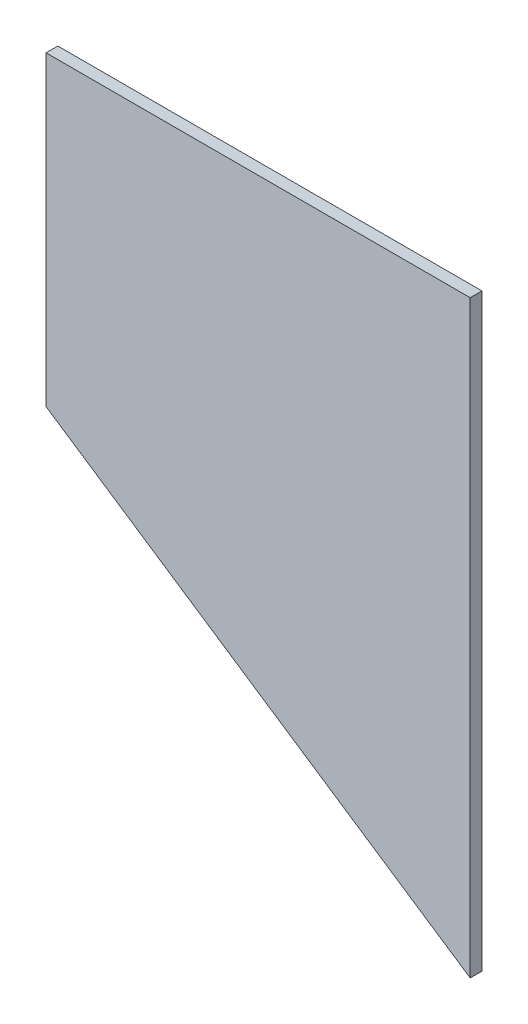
from build123d import *


with BuildPart() as part:
    # Sketch1 → Tapered_plywood_panel section 0
    with BuildSketch(Plane.YZ):
        with BuildLine():
            Line((-82.55, 76.2), (82.55, 76.2))
            Line((82.55, 76.2), (82.55, 82.55))
            Line((82.55, 82.55), (-82.55, 82.55))
            Line((-82.55, 82.55), (-82.55, 76.2))
        make_face()
    # Sketch2 → Tapered_plywood_panel section 1
    with BuildSketch(Plane.YZ.offset(304.8)):
        with BuildLine():
            Line((-158.75, 152.4), (158.75, 152.4))
            Line((158.75, 152.4), (158.75, 158.75))
            Line((158.75, 158.75), (-158.75, 158.75))
            Line((-158.75, 158.75), (-158.75, 152.4))
        make_face()
    loft()


solid = part.part
